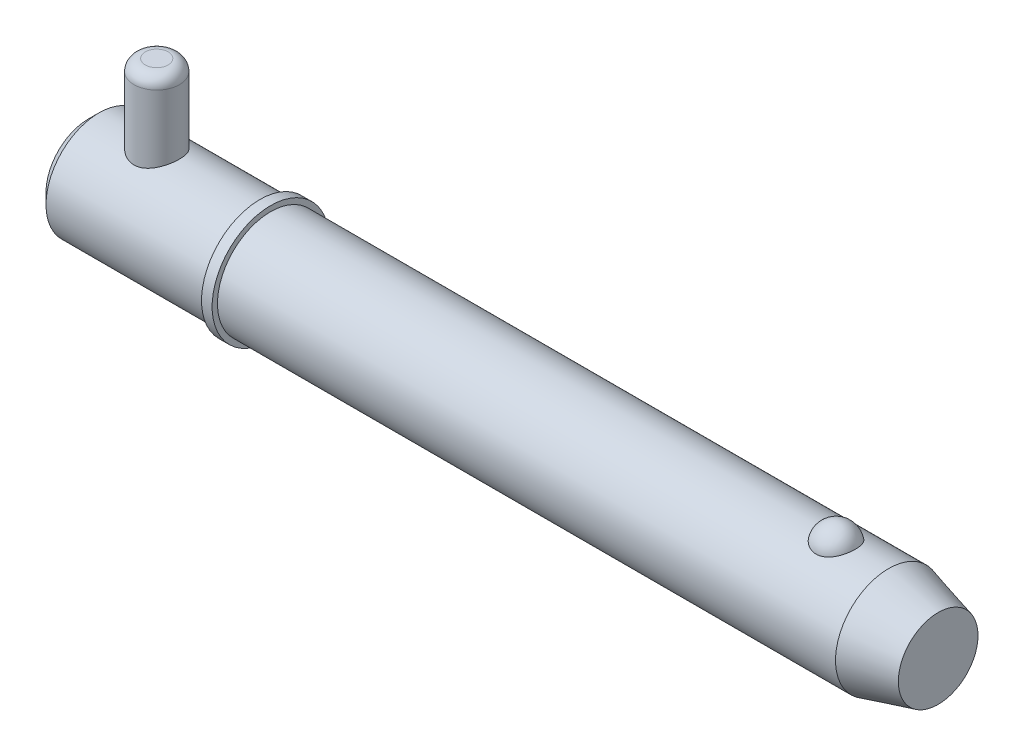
ISO-10303-21;
HEADER;
FILE_DESCRIPTION(('STEP AP214'),'2;1');
FILE_NAME('part.step','',(''),(''),'','','');
FILE_SCHEMA(('AUTOMOTIVE_DESIGN { 1 0 10303 214 1 1 1 1 }'));
ENDSEC;
DATA;
#1=APPLICATION_CONTEXT('core data for automotive mechanical design processes');
#2=APPLICATION_PROTOCOL_DEFINITION('international standard','automotive_design',2000,#1);
#3=PRODUCT_CONTEXT('',#1,'mechanical');
#4=PRODUCT('Part','Part','',(#3));
#5=PRODUCT_RELATED_PRODUCT_CATEGORY('part','',(#4));
#6=PRODUCT_DEFINITION_FORMATION('','',#4);
#7=PRODUCT_DEFINITION_CONTEXT('part definition',#1,'design');
#8=PRODUCT_DEFINITION('design','',#6,#7);
#9=PRODUCT_DEFINITION_SHAPE('','',#8);
#10=(LENGTH_UNIT() NAMED_UNIT(*) SI_UNIT(.MILLI.,.METRE.));
#11=(NAMED_UNIT(*) PLANE_ANGLE_UNIT() SI_UNIT($,.RADIAN.));
#12=(NAMED_UNIT(*) SI_UNIT($,.STERADIAN.) SOLID_ANGLE_UNIT());
#13=UNCERTAINTY_MEASURE_WITH_UNIT(LENGTH_MEASURE(1.E-05),#10,'distance_accuracy_value','');
#14=(GEOMETRIC_REPRESENTATION_CONTEXT(3) GLOBAL_UNCERTAINTY_ASSIGNED_CONTEXT((#13)) GLOBAL_UNIT_ASSIGNED_CONTEXT((#10,
#11,#12)) REPRESENTATION_CONTEXT('',''));
#15=CARTESIAN_POINT('',(0.,0.,0.));
#16=DIRECTION('',(0.,0.,1.));
#17=DIRECTION('',(1.,0.,0.));
#18=AXIS2_PLACEMENT_3D('',#15,#16,#17);
#19=CARTESIAN_POINT('',(14.28,26.985,0.));
#20=DIRECTION('',(0.,-1.,0.));
#21=DIRECTION('',(0.,0.,-1.));
#22=AXIS2_PLACEMENT_3D('',#19,#20,#21);
#23=CYLINDRICAL_SURFACE('',#22,4.76);
#24=CARTESIAN_POINT('',(14.28,-8.73500000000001,0.));
#25=DIRECTION('',(0.,1.,0.));
#26=DIRECTION('',(0.,0.,1.));
#27=AXIS2_PLACEMENT_3D('',#24,#25,#26);
#28=CIRCLE('',#27,4.76);
#29=CARTESIAN_POINT('',(14.28,-8.73500000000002,-4.76));
#30=VERTEX_POINT('',#29);
#31=EDGE_CURVE('P0_E25',#30,#30,#28,.T.);
#32=CARTESIAN_POINT('',(14.28,24.605,0.));
#33=DIRECTION('',(0.,1.,0.));
#34=DIRECTION('',(0.,0.,1.));
#35=AXIS2_PLACEMENT_3D('',#32,#33,#34);
#36=CIRCLE('',#35,4.76);
#37=CARTESIAN_POINT('',(14.28,24.605,-4.76));
#38=VERTEX_POINT('',#37);
#39=EDGE_CURVE('P0_E29',#38,#38,#36,.F.);
#40=CARTESIAN_POINT('',(14.28,-8.73500000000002,-4.76));
#41=CARTESIAN_POINT('',(14.28,-8.38770833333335,-4.76));
#42=CARTESIAN_POINT('',(14.28,-8.04041666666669,-4.76));
#43=CARTESIAN_POINT('',(14.28,-7.34583333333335,-4.76));
#44=CARTESIAN_POINT('',(14.28,-6.99854166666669,-4.76));
#45=CARTESIAN_POINT('',(14.28,-6.30395833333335,-4.76));
#46=CARTESIAN_POINT('',(14.28,-5.95666666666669,-4.76));
#47=CARTESIAN_POINT('',(14.28,-5.26208333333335,-4.76));
#48=CARTESIAN_POINT('',(14.28,-4.91479166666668,-4.76));
#49=CARTESIAN_POINT('',(14.28,-4.22020833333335,-4.76));
#50=CARTESIAN_POINT('',(14.28,-3.87291666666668,-4.76));
#51=CARTESIAN_POINT('',(14.28,-3.17833333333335,-4.76));
#52=CARTESIAN_POINT('',(14.28,-2.83104166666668,-4.76));
#53=CARTESIAN_POINT('',(14.28,-2.13645833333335,-4.76));
#54=CARTESIAN_POINT('',(14.28,-1.78916666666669,-4.76));
#55=CARTESIAN_POINT('',(14.28,-1.09458333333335,-4.76));
#56=CARTESIAN_POINT('',(14.28,-0.747291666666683,-4.76));
#57=CARTESIAN_POINT('',(14.28,-0.052708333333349,-4.76));
#58=CARTESIAN_POINT('',(14.28,0.294583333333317,-4.76));
#59=CARTESIAN_POINT('',(14.28,0.989166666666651,-4.76));
#60=CARTESIAN_POINT('',(14.28,1.33645833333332,-4.76));
#61=CARTESIAN_POINT('',(14.28,2.03104166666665,-4.76));
#62=CARTESIAN_POINT('',(14.28,2.37833333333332,-4.76));
#63=CARTESIAN_POINT('',(14.28,3.07291666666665,-4.76));
#64=CARTESIAN_POINT('',(14.28,3.42020833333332,-4.76));
#65=CARTESIAN_POINT('',(14.28,4.11479166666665,-4.76));
#66=CARTESIAN_POINT('',(14.28,4.46208333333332,-4.76));
#67=CARTESIAN_POINT('',(14.28,5.15666666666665,-4.76));
#68=CARTESIAN_POINT('',(14.28,5.50395833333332,-4.76));
#69=CARTESIAN_POINT('',(14.28,6.19854166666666,-4.76));
#70=CARTESIAN_POINT('',(14.28,6.54583333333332,-4.76));
#71=CARTESIAN_POINT('',(14.28,7.24041666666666,-4.76));
#72=CARTESIAN_POINT('',(14.28,7.58770833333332,-4.76));
#73=CARTESIAN_POINT('',(14.28,8.28229166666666,-4.76));
#74=CARTESIAN_POINT('',(14.28,8.62958333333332,-4.76));
#75=CARTESIAN_POINT('',(14.28,9.32416666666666,-4.76));
#76=CARTESIAN_POINT('',(14.28,9.67145833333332,-4.76));
#77=CARTESIAN_POINT('',(14.28,10.3660416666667,-4.76));
#78=CARTESIAN_POINT('',(14.28,10.7133333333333,-4.76));
#79=CARTESIAN_POINT('',(14.28,11.4079166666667,-4.76));
#80=CARTESIAN_POINT('',(14.28,11.7552083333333,-4.76));
#81=CARTESIAN_POINT('',(14.28,12.4497916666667,-4.76));
#82=CARTESIAN_POINT('',(14.28,12.7970833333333,-4.76));
#83=CARTESIAN_POINT('',(14.28,13.4916666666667,-4.76));
#84=CARTESIAN_POINT('',(14.28,13.8389583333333,-4.76));
#85=CARTESIAN_POINT('',(14.28,14.5335416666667,-4.76));
#86=CARTESIAN_POINT('',(14.28,14.8808333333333,-4.76));
#87=CARTESIAN_POINT('',(14.28,15.5754166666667,-4.76));
#88=CARTESIAN_POINT('',(14.28,15.9227083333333,-4.76));
#89=CARTESIAN_POINT('',(14.28,16.6172916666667,-4.76));
#90=CARTESIAN_POINT('',(14.28,16.9645833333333,-4.76));
#91=CARTESIAN_POINT('',(14.28,17.6591666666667,-4.76));
#92=CARTESIAN_POINT('',(14.28,18.0064583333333,-4.76));
#93=CARTESIAN_POINT('',(14.28,18.7010416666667,-4.76));
#94=CARTESIAN_POINT('',(14.28,19.0483333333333,-4.76));
#95=CARTESIAN_POINT('',(14.28,19.7429166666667,-4.76));
#96=CARTESIAN_POINT('',(14.28,20.0902083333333,-4.76));
#97=CARTESIAN_POINT('',(14.28,20.7847916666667,-4.76));
#98=CARTESIAN_POINT('',(14.28,21.1320833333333,-4.76));
#99=CARTESIAN_POINT('',(14.28,21.8266666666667,-4.76));
#100=CARTESIAN_POINT('',(14.28,22.1739583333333,-4.76));
#101=CARTESIAN_POINT('',(14.28,22.8685416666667,-4.76));
#102=CARTESIAN_POINT('',(14.28,23.2158333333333,-4.76));
#103=CARTESIAN_POINT('',(14.28,23.9104166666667,-4.76));
#104=CARTESIAN_POINT('',(14.28,24.2577083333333,-4.76));
#105=CARTESIAN_POINT('',(14.28,24.605,-4.76));
#106=B_SPLINE_CURVE_WITH_KNOTS('',3,(#40,#41,#42,#43,#44,#45,#46,#47,#48,#49,#50,#51,#52,#53,
#54,#55,#56,#57,#58,#59,#60,#61,#62,#63,#64,#65,#66,#67,#68,#69,#70,#71,#72,#73,#74,#75,#76,#77,
#78,#79,#80,#81,#82,#83,#84,#85,#86,#87,#88,#89,#90,#91,#92,#93,#94,#95,#96,#97,#98,#99,#100,
#101,#102,#103,#104,#105),.UNSPECIFIED.,.F.,.F.,(4,2,2,2,2,2,2,2,2,2,2,2,2,2,2,2,2,2,2,2,2,2,2,
2,2,2,2,2,2,2,2,2,4),(0.,1.041875,2.08375,3.125625,4.1675,5.209375,6.25125,7.293125,
8.33500000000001,9.376875,10.41875,11.460625,12.5025,13.544375,14.58625,15.628125,16.67,
17.711875,18.75375,19.795625,20.8375,21.879375,22.92125,23.963125,25.005,26.046875,27.08875,
28.130625,29.1725,30.214375,31.25625,32.298125,33.34),.UNSPECIFIED.);
#107=EDGE_CURVE('P0_BSEAM14',#30,#38,#106,.T.);
#108=ORIENTED_EDGE('',*,*,#31,.T.);
#109=ORIENTED_EDGE('',*,*,#39,.T.);
#110=ORIENTED_EDGE('',*,*,#107,.T.);
#111=ORIENTED_EDGE('',*,*,#107,.F.);
#112=EDGE_LOOP('',(#108,#110,#109,#111));
#113=FACE_BOUND('',#112,.T.);
#114=ADVANCED_FACE('P0_F14',(#113),#23,.T.);
#115=CARTESIAN_POINT('',(14.28,26.985,0.));
#116=DIRECTION('',(0.,1.,0.));
#117=DIRECTION('',(0.,0.,1.));
#118=AXIS2_PLACEMENT_3D('',#115,#116,#117);
#119=PLANE('',#118);
#120=CARTESIAN_POINT('',(14.28,26.985,0.));
#121=DIRECTION('',(0.,1.,0.));
#122=DIRECTION('',(0.,0.,1.));
#123=AXIS2_PLACEMENT_3D('',#120,#121,#122);
#124=CIRCLE('',#123,2.38);
#125=CARTESIAN_POINT('',(14.28,26.985,2.38));
#126=VERTEX_POINT('',#125);
#127=EDGE_CURVE('P0_E10',#126,#126,#124,.T.);
#128=ORIENTED_EDGE('',*,*,#127,.T.);
#129=EDGE_LOOP('',(#128));
#130=FACE_BOUND('',#129,.T.);
#131=ADVANCED_FACE('P0_F46',(#130),#119,.T.);
#132=CARTESIAN_POINT('',(14.28,-11.115,0.));
#133=DIRECTION('',(0.,1.,0.));
#134=DIRECTION('',(0.,0.,1.));
#135=AXIS2_PLACEMENT_3D('',#132,#133,#134);
#136=PLANE('',#135);
#137=CARTESIAN_POINT('',(14.28,-11.115,0.));
#138=DIRECTION('',(0.,1.,0.));
#139=DIRECTION('',(0.,0.,1.));
#140=AXIS2_PLACEMENT_3D('',#137,#138,#139);
#141=CIRCLE('',#140,2.38);
#142=CARTESIAN_POINT('',(14.28,-11.115,2.38));
#143=VERTEX_POINT('',#142);
#144=EDGE_CURVE('P0_E21',#143,#143,#141,.F.);
#145=ORIENTED_EDGE('',*,*,#144,.T.);
#146=EDGE_LOOP('',(#145));
#147=FACE_BOUND('',#146,.T.);
#148=ADVANCED_FACE('P0_F43',(#147),#136,.F.);
#149=CARTESIAN_POINT('',(14.28,-8.735,0.));
#150=DIRECTION('',(0.,1.,0.));
#151=DIRECTION('',(0.,0.,1.));
#152=AXIS2_PLACEMENT_3D('',#149,#150,#151);
#153=DEGENERATE_TOROIDAL_SURFACE('',#152,2.38,2.38,.T.);
#154=ORIENTED_EDGE('',*,*,#144,.F.);
#155=EDGE_LOOP('',(#154));
#156=FACE_BOUND('',#155,.T.);
#157=ORIENTED_EDGE('',*,*,#31,.F.);
#158=EDGE_LOOP('',(#157));
#159=FACE_BOUND('',#158,.T.);
#160=ADVANCED_FACE('P0_F38',(#156,#159),#153,.T.);
#161=CARTESIAN_POINT('',(14.28,24.605,0.));
#162=DIRECTION('',(0.,1.,0.));
#163=DIRECTION('',(0.,0.,1.));
#164=AXIS2_PLACEMENT_3D('',#161,#162,#163);
#165=DEGENERATE_TOROIDAL_SURFACE('',#164,2.38,2.38,.T.);
#166=ORIENTED_EDGE('',*,*,#39,.F.);
#167=EDGE_LOOP('',(#166));
#168=FACE_BOUND('',#167,.T.);
#169=ORIENTED_EDGE('',*,*,#127,.F.);
#170=EDGE_LOOP('',(#169));
#171=FACE_BOUND('',#170,.T.);
#172=ADVANCED_FACE('P0_F16',(#168,#171),#165,.T.);
#173=CLOSED_SHELL('',(#114,#131,#148,#160,#172));
#174=MANIFOLD_SOLID_BREP('P0_B1',#173);
#175=CARTESIAN_POINT('',(0.,0.,0.));
#176=DIRECTION('',(1.,0.,0.));
#177=DIRECTION('',(0.,0.,-1.));
#178=AXIS2_PLACEMENT_3D('',#175,#176,#177);
#179=CYLINDRICAL_SURFACE('',#178,11.115);
#180=CARTESIAN_POINT('',(167.429563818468,0.,0.));
#181=DIRECTION('',(1.,0.,0.));
#182=DIRECTION('',(0.,0.,-1.));
#183=AXIS2_PLACEMENT_3D('',#180,#181,#182);
#184=CIRCLE('',#183,11.115);
#185=CARTESIAN_POINT('',(167.429563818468,0.,-11.115));
#186=VERTEX_POINT('',#185);
#187=EDGE_CURVE('P1_E81',#186,#186,#184,.T.);
#188=ORIENTED_EDGE('',*,*,#187,.F.);
#189=EDGE_LOOP('',(#188));
#190=FACE_BOUND('',#189,.T.);
#191=CARTESIAN_POINT('',(38.1,0.,0.));
#192=DIRECTION('',(1.,0.,0.));
#193=DIRECTION('',(0.,0.,-1.));
#194=AXIS2_PLACEMENT_3D('',#191,#192,#193);
#195=CIRCLE('',#194,11.115);
#196=CARTESIAN_POINT('',(38.1,0.,-11.115));
#197=VERTEX_POINT('',#196);
#198=EDGE_CURVE('P1_E85',#197,#197,#195,.T.);
#199=ORIENTED_EDGE('',*,*,#198,.T.);
#200=EDGE_LOOP('',(#199));
#201=FACE_BOUND('',#200,.T.);
#202=CARTESIAN_POINT('',(156.431068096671,10.3028087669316,4.17077409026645));
#203=CARTESIAN_POINT('',(156.214775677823,10.3028003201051,4.17078240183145));
#204=CARTESIAN_POINT('',(155.998548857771,10.3098895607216,4.15340593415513));
#205=CARTESIAN_POINT('',(155.572540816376,10.3373834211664,4.08449540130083));
#206=CARTESIAN_POINT('',(155.362757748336,10.3577841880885,4.0329712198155));
#207=CARTESIAN_POINT('',(154.955782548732,10.4095237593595,3.89746513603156));
#208=CARTESIAN_POINT('',(154.758572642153,10.4408466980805,3.81353029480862));
#209=CARTESIAN_POINT('',(154.381338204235,10.5110236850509,3.61560339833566));
#210=CARTESIAN_POINT('',(154.201317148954,10.5498792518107,3.50160528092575));
#211=CARTESIAN_POINT('',(153.857684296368,10.6322884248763,3.24292464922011));
#212=CARTESIAN_POINT('',(153.694686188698,10.6759443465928,3.09746040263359));
#213=CARTESIAN_POINT('',(153.394591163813,10.7625291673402,2.7817192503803));
#214=CARTESIAN_POINT('',(153.257499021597,10.8054579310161,2.61143778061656));
#215=CARTESIAN_POINT('',(153.006408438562,10.8881935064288,2.24226695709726));
#216=CARTESIAN_POINT('',(152.893710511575,10.9277761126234,2.04244123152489));
#217=CARTESIAN_POINT('',(152.701777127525,10.997484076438,1.62578254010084));
#218=CARTESIAN_POINT('',(152.622544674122,11.0276085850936,1.40894804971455));
#219=CARTESIAN_POINT('',(152.498303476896,11.0756732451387,0.961250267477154));
#220=CARTESIAN_POINT('',(152.453760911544,11.0934470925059,0.730239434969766));
#221=CARTESIAN_POINT('',(152.401569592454,11.1143331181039,0.263439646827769));
#222=CARTESIAN_POINT('',(152.393920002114,11.1174456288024,0.0276507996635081));
#223=CARTESIAN_POINT('',(152.41561056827,11.1087161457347,-0.440729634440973));
#224=CARTESIAN_POINT('',(152.444762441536,11.0969502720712,-0.6733313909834));
#225=CARTESIAN_POINT('',(152.539143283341,11.0597872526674,-1.12996621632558));
#226=CARTESIAN_POINT('',(152.604372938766,11.0343898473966,-1.35399912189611));
#227=CARTESIAN_POINT('',(152.76969844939,10.972515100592,-1.78750286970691));
#228=CARTESIAN_POINT('',(152.86983863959,10.9360236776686,-1.99695478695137));
#229=CARTESIAN_POINT('',(153.102940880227,10.8557595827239,-2.39520667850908));
#230=CARTESIAN_POINT('',(153.235905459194,10.8119863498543,-2.58400506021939));
#231=CARTESIAN_POINT('',(153.532407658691,10.7216733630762,-2.93635726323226));
#232=CARTESIAN_POINT('',(153.696056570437,10.675123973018,-3.09981510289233));
#233=CARTESIAN_POINT('',(154.049860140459,10.5846571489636,-3.39592247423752));
#234=CARTESIAN_POINT('',(154.240012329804,10.5407394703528,-3.52857487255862));
#235=CARTESIAN_POINT('',(154.63750141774,10.4616690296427,-3.75646057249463));
#236=CARTESIAN_POINT('',(154.84436705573,10.4263443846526,-3.85245432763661));
#237=CARTESIAN_POINT('',(155.272954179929,10.3675574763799,-4.00798747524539));
#238=CARTESIAN_POINT('',(155.494670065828,10.344090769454,-4.0675405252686));
#239=CARTESIAN_POINT('',(155.934669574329,10.3128282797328,-4.14614314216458));
#240=CARTESIAN_POINT('',(156.152565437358,10.3043040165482,-4.1670783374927));
#241=CARTESIAN_POINT('',(156.58894951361,10.3016771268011,-4.17357158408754));
#242=CARTESIAN_POINT('',(156.807437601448,10.3075716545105,-4.15913661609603));
#243=CARTESIAN_POINT('',(157.231744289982,10.3326686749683,-4.09636961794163));
#244=CARTESIAN_POINT('',(157.437745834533,10.3514555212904,-4.0490957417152));
#245=CARTESIAN_POINT('',(157.838576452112,10.399818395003,-3.92320197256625));
#246=CARTESIAN_POINT('',(158.0334046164,10.4293952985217,-3.84457953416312));
#247=CARTESIAN_POINT('',(158.411191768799,10.4969600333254,-3.65612410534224));
#248=CARTESIAN_POINT('',(158.593797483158,10.5351178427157,-3.54564545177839));
#249=CARTESIAN_POINT('',(158.938204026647,10.6154999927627,-3.29718036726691));
#250=CARTESIAN_POINT('',(159.100000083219,10.657725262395,-3.15918764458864));
#251=CARTESIAN_POINT('',(159.406959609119,10.744212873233,-2.85163580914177));
#252=CARTESIAN_POINT('',(159.550891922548,10.7884718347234,-2.68084605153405));
#253=CARTESIAN_POINT('',(159.809237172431,10.872374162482,-2.31721864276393));
#254=CARTESIAN_POINT('',(159.923644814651,10.9120167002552,-2.12437704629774));
#255=CARTESIAN_POINT('',(160.123873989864,10.9838919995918,-1.71516999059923));
#256=CARTESIAN_POINT('',(160.20866178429,11.0158465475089,-1.49824866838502));
#257=CARTESIAN_POINT('',(160.34268382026,11.0673523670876,-1.05228572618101));
#258=CARTESIAN_POINT('',(160.391917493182,11.086903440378,-0.823243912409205));
#259=CARTESIAN_POINT('',(160.453891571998,11.1116323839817,-0.359087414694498));
#260=CARTESIAN_POINT('',(160.466566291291,11.1167843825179,-0.123962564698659));
#261=CARTESIAN_POINT('',(160.454973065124,11.1121144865,0.345220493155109));
#262=CARTESIAN_POINT('',(160.430705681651,11.1022928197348,0.579278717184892));
#263=CARTESIAN_POINT('',(160.345907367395,11.0687504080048,1.03866534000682));
#264=CARTESIAN_POINT('',(160.285529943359,11.0450885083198,1.26402641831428));
#265=CARTESIAN_POINT('',(160.129853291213,10.9863185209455,1.70076772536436));
#266=CARTESIAN_POINT('',(160.034551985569,10.9512097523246,1.91214712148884));
#267=CARTESIAN_POINT('',(159.810397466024,10.8729733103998,2.316083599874));
#268=CARTESIAN_POINT('',(159.681380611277,10.8298068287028,2.50854240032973));
#269=CARTESIAN_POINT('',(159.392732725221,10.7401896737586,2.86808766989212));
#270=CARTESIAN_POINT('',(159.233102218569,10.6937390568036,3.03517457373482));
#271=CARTESIAN_POINT('',(158.887534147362,10.6029321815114,3.33857581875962));
#272=CARTESIAN_POINT('',(158.701708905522,10.5585680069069,3.47501541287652));
#273=CARTESIAN_POINT('',(158.307875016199,10.4769321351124,3.71390897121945));
#274=CARTESIAN_POINT('',(158.099863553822,10.439661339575,3.81635861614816));
#275=CARTESIAN_POINT('',(157.654066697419,10.3749407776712,3.98910631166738));
#276=CARTESIAN_POINT('',(157.415234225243,10.3482457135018,4.05700929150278));
#277=CARTESIAN_POINT('',(156.927925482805,10.312188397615,4.14782844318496));
#278=CARTESIAN_POINT('',(156.679453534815,10.3028184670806,4.17076454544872));
#279=CARTESIAN_POINT('',(156.431068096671,10.3028087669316,4.17077409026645));
#280=B_SPLINE_CURVE_WITH_KNOTS('',3,(#202,#203,#204,#205,#206,#207,#208,#209,#210,#211,#212,
#213,#214,#215,#216,#217,#218,#219,#220,#221,#222,#223,#224,#225,#226,#227,#228,#229,#230,#231,
#232,#233,#234,#235,#236,#237,#238,#239,#240,#241,#242,#243,#244,#245,#246,#247,#248,#249,#250,
#251,#252,#253,#254,#255,#256,#257,#258,#259,#260,#261,#262,#263,#264,#265,#266,#267,#268,#269,
#270,#271,#272,#273,#274,#275,#276,#277,#278,#279),.UNSPECIFIED.,.T.,.F.,(4,2,2,2,2,2,2,2,2,2,2,
2,2,2,2,2,2,2,2,2,2,2,2,2,2,2,2,2,2,2,2,2,2,2,2,2,2,2,4),(0.,0.64796614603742,1.29574482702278,
1.9425864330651,2.58955857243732,3.25496465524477,3.92049326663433,4.61566368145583,
5.31089647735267,6.01531821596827,6.71972398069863,7.42054043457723,8.12137023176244,
8.82309331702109,9.52487047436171,10.2292439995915,10.9335519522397,11.6223330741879,
12.3108558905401,12.9647664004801,13.6185478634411,14.252184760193,14.8858731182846,
15.5334360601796,16.1811472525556,16.8611459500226,17.5412664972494,18.2431855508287,
18.9451158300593,19.6483065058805,20.3514864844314,21.0516982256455,21.7519516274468,
22.4556690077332,23.1593743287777,23.860149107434,24.5610129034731,25.3054529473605,
26.049562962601),.UNSPECIFIED.);
#281=CARTESIAN_POINT('',(156.431068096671,10.3028087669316,4.17077409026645));
#282=VERTEX_POINT('',#281);
#283=EDGE_CURVE('P1_E35',#282,#282,#280,.T.);
#284=ORIENTED_EDGE('',*,*,#283,.T.);
#285=EDGE_LOOP('',(#284));
#286=FACE_BOUND('',#285,.T.);
#287=ADVANCED_FACE('P1_F13',(#190,#201,#286),#179,.T.);
#288=CARTESIAN_POINT('',(0.,0.,0.));
#289=DIRECTION('',(-1.,0.,0.));
#290=DIRECTION('',(0.,0.,1.));
#291=AXIS2_PLACEMENT_3D('',#288,#289,#290);
#292=PLANE('',#291);
#293=CARTESIAN_POINT('',(0.,0.,0.));
#294=DIRECTION('',(1.,0.,0.));
#295=DIRECTION('',(0.,0.,-1.));
#296=AXIS2_PLACEMENT_3D('',#293,#294,#295);
#297=CIRCLE('',#296,8.892);
#298=CARTESIAN_POINT('',(0.,0.,-8.892));
#299=VERTEX_POINT('',#298);
#300=EDGE_CURVE('P1_E9',#299,#299,#297,.T.);
#301=ORIENTED_EDGE('',*,*,#300,.F.);
#302=EDGE_LOOP('',(#301));
#303=FACE_BOUND('',#302,.T.);
#304=ADVANCED_FACE('P1_F15',(#303),#292,.T.);
#305=CARTESIAN_POINT('',(2.22299999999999,0.,0.));
#306=DIRECTION('',(1.,0.,0.));
#307=DIRECTION('',(0.,0.,-1.));
#308=AXIS2_PLACEMENT_3D('',#305,#306,#307);
#309=CONICAL_SURFACE('',#308,11.115,0.78539816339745);
#310=ORIENTED_EDGE('',*,*,#300,.T.);
#311=EDGE_LOOP('',(#310));
#312=FACE_BOUND('',#311,.T.);
#313=CARTESIAN_POINT('',(2.22299999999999,0.,0.));
#314=DIRECTION('',(1.,0.,0.));
#315=DIRECTION('',(0.,0.,-1.));
#316=AXIS2_PLACEMENT_3D('',#313,#314,#315);
#317=CIRCLE('',#316,11.115);
#318=CARTESIAN_POINT('',(2.22299999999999,0.,-11.115));
#319=VERTEX_POINT('',#318);
#320=EDGE_CURVE('P1_E26',#319,#319,#317,.T.);
#321=ORIENTED_EDGE('',*,*,#320,.F.);
#322=EDGE_LOOP('',(#321));
#323=FACE_BOUND('',#322,.T.);
#324=ADVANCED_FACE('P1_F77',(#312,#323),#309,.T.);
#325=CARTESIAN_POINT('',(0.,0.,0.));
#326=DIRECTION('',(1.,0.,0.));
#327=DIRECTION('',(0.,0.,-1.));
#328=AXIS2_PLACEMENT_3D('',#325,#326,#327);
#329=CYLINDRICAL_SURFACE('',#328,11.115);
#330=CARTESIAN_POINT('',(14.28,-10.0441836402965,4.76));
#331=CARTESIAN_POINT('',(14.1533731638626,-10.0441846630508,4.75999904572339));
#332=CARTESIAN_POINT('',(14.0267055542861,-10.0465865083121,4.75493985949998));
#333=CARTESIAN_POINT('',(13.774298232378,-10.0561141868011,4.73475585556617));
#334=CARTESIAN_POINT('',(13.6485591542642,-10.0632429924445,4.71962470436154));
#335=CARTESIAN_POINT('',(13.3987500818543,-10.0819979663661,4.67942666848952));
#336=CARTESIAN_POINT('',(13.2746840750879,-10.0936334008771,4.65433930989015));
#337=CARTESIAN_POINT('',(13.0293244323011,-10.1210146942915,4.59449317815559));
#338=CARTESIAN_POINT('',(12.9080319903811,-10.1367622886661,4.55973032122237));
#339=CARTESIAN_POINT('',(12.669614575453,-10.1717810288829,4.48106435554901));
#340=CARTESIAN_POINT('',(12.5524727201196,-10.1910352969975,4.4372048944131));
#341=CARTESIAN_POINT('',(12.3224300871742,-10.2325403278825,4.34063417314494));
#342=CARTESIAN_POINT('',(12.2095309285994,-10.2547922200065,4.28791957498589));
#343=CARTESIAN_POINT('',(11.8782785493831,-10.3250879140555,4.11715127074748));
#344=CARTESIAN_POINT('',(11.6670799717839,-10.3767168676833,3.98637638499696));
#345=CARTESIAN_POINT('',(11.2564039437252,-10.4874309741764,3.68567149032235));
#346=CARTESIAN_POINT('',(11.0583793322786,-10.5467772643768,3.51386978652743));
#347=CARTESIAN_POINT('',(10.6927724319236,-10.6641377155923,3.13969960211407));
#348=CARTESIAN_POINT('',(10.5252022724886,-10.7221513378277,2.93731900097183));
#349=CARTESIAN_POINT('',(10.2965609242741,-10.8050020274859,2.60935726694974));
#350=CARTESIAN_POINT('',(10.2227768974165,-10.8324811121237,2.49310321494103));
#351=CARTESIAN_POINT('',(10.0853380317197,-10.884703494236,2.25418999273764));
#352=CARTESIAN_POINT('',(10.0216789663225,-10.9094479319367,2.13153352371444));
#353=CARTESIAN_POINT('',(9.90506238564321,-10.9554932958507,1.88060370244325));
#354=CARTESIAN_POINT('',(9.85210574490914,-10.9767939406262,1.7523298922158));
#355=CARTESIAN_POINT('',(9.75746464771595,-11.0153112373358,1.49115740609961));
#356=CARTESIAN_POINT('',(9.71577447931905,-11.0325299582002,1.35826111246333));
#357=CARTESIAN_POINT('',(9.64605475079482,-11.0615607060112,1.09614539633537));
#358=CARTESIAN_POINT('',(9.61740732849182,-11.0736151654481,0.96711700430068));
#359=CARTESIAN_POINT('',(9.57092026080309,-11.0932687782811,0.706847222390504));
#360=CARTESIAN_POINT('',(9.55307574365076,-11.1008699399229,0.575606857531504));
#361=CARTESIAN_POINT('',(9.52838640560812,-11.1114054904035,0.31192917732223));
#362=CARTESIAN_POINT('',(9.52153986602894,-11.114340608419,0.179492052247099));
#363=CARTESIAN_POINT('',(9.51892405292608,-11.1154607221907,-0.0855090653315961));
#364=CARTESIAN_POINT('',(9.52315432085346,-11.1136459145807,-0.218073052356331));
#365=CARTESIAN_POINT('',(9.542009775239,-11.1055891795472,-0.473709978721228));
#366=CARTESIAN_POINT('',(9.55594693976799,-11.099640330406,-0.596843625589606));
#367=CARTESIAN_POINT('',(9.59332832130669,-11.0837823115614,-0.841440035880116));
#368=CARTESIAN_POINT('',(9.61677567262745,-11.0738718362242,-0.962902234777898));
#369=CARTESIAN_POINT('',(9.67294089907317,-11.0503378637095,-1.20325684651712));
#370=CARTESIAN_POINT('',(9.70565569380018,-11.0367156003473,-1.32215009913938));
#371=CARTESIAN_POINT('',(9.78005008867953,-11.0060908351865,-1.55666640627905));
#372=CARTESIAN_POINT('',(9.82173311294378,-10.9890870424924,-1.67228819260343));
#373=CARTESIAN_POINT('',(9.96110379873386,-10.9330280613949,-2.01656166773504));
#374=CARTESIAN_POINT('',(10.0722987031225,-10.8892801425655,-2.23915547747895));
#375=CARTESIAN_POINT('',(10.3268588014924,-10.7934745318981,-2.66299199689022));
#376=CARTESIAN_POINT('',(10.4702355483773,-10.7414138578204,-2.86422700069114));
#377=CARTESIAN_POINT('',(10.7973904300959,-10.6296201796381,-3.25557775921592));
#378=CARTESIAN_POINT('',(10.9833705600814,-10.569604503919,-3.443774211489));
#379=CARTESIAN_POINT('',(11.3844486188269,-10.4514707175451,-3.78722133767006));
#380=CARTESIAN_POINT('',(11.5995590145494,-10.3933534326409,-3.94245783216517));
#381=CARTESIAN_POINT('',(11.9444340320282,-10.311516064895,-4.14990014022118));
#382=CARTESIAN_POINT('',(12.0654579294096,-10.2847012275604,-4.21573894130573));
#383=CARTESIAN_POINT('',(12.3132718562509,-10.2342051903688,-4.33688518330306));
#384=CARTESIAN_POINT('',(12.4400593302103,-10.2105226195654,-4.39219723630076));
#385=CARTESIAN_POINT('',(12.6985418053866,-10.1671237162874,-4.49174500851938));
#386=CARTESIAN_POINT('',(12.8302359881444,-10.1474067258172,-4.53598256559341));
#387=CARTESIAN_POINT('',(13.0975061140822,-10.1126841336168,-4.61287629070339));
#388=CARTESIAN_POINT('',(13.233079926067,-10.0976759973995,-4.64553869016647));
#389=CARTESIAN_POINT('',(13.4978553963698,-10.0737863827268,-4.6971059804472));
#390=CARTESIAN_POINT('',(13.6268754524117,-10.0645618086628,-4.716785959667));
#391=CARTESIAN_POINT('',(13.8862990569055,-10.051062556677,-4.74548419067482));
#392=CARTESIAN_POINT('',(14.0167019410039,-10.0467856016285,-4.75450734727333));
#393=CARTESIAN_POINT('',(14.277859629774,-10.0433352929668,-4.76179143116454));
#394=CARTESIAN_POINT('',(14.4086143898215,-10.0441613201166,-4.76005366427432));
#395=CARTESIAN_POINT('',(14.6694025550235,-10.0508838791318,-4.74584231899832));
#396=CARTESIAN_POINT('',(14.7994359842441,-10.0567802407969,-4.73336910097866));
#397=CARTESIAN_POINT('',(15.0487369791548,-10.0728449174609,-4.69907984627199));
#398=CARTESIAN_POINT('',(15.1681238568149,-10.0826872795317,-4.67797462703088));
#399=CARTESIAN_POINT('',(15.4045894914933,-10.1062580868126,-4.62682977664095));
#400=CARTESIAN_POINT('',(15.5216674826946,-10.1199877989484,-4.59678723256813));
#401=CARTESIAN_POINT('',(15.868278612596,-10.1664161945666,-4.49365911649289));
#402=CARTESIAN_POINT('',(16.0933756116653,-10.2043671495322,-4.40754694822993));
#403=CARTESIAN_POINT('',(16.5357981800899,-10.2919879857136,-4.19898201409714));
#404=CARTESIAN_POINT('',(16.7523611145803,-10.3420954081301,-4.07511281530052));
#405=CARTESIAN_POINT('',(17.1627188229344,-10.4477911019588,-3.7959429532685));
#406=CARTESIAN_POINT('',(17.3565033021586,-10.5033818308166,-3.64062816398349));
#407=CARTESIAN_POINT('',(17.7334034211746,-10.6196376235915,-3.28693729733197));
#408=CARTESIAN_POINT('',(17.9141276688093,-10.6803237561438,-3.08599175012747));
#409=CARTESIAN_POINT('',(18.1582189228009,-10.7666348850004,-2.76320365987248));
#410=CARTESIAN_POINT('',(18.2351223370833,-10.7946346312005,-2.65197124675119));
#411=CARTESIAN_POINT('',(18.3793967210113,-10.8483267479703,-2.42297927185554));
#412=CARTESIAN_POINT('',(18.4467718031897,-10.87402011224,-2.30522255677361));
#413=CARTESIAN_POINT('',(18.5717669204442,-10.9225249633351,-2.06324665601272));
#414=CARTESIAN_POINT('',(18.6293326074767,-10.9453202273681,-1.93899615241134));
#415=CARTESIAN_POINT('',(18.73370006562,-10.9872100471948,-1.6855059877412));
#416=CARTESIAN_POINT('',(18.7805065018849,-11.0063062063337,-1.55626851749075));
#417=CARTESIAN_POINT('',(18.8628731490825,-11.0402419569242,-1.29375150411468));
#418=CARTESIAN_POINT('',(18.8984366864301,-11.0550828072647,-1.16047316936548));
#419=CARTESIAN_POINT('',(18.9579183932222,-11.0800638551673,-0.890912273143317));
#420=CARTESIAN_POINT('',(18.9818374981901,-11.0902044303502,-0.75462995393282));
#421=CARTESIAN_POINT('',(19.0164177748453,-11.104911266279,-0.490295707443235));
#422=CARTESIAN_POINT('',(19.027922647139,-11.1098318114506,-0.362373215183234));
#423=CARTESIAN_POINT('',(19.040554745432,-11.1152360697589,-0.105876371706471));
#424=CARTESIAN_POINT('',(19.0416784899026,-11.1157182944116,0.0226981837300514));
#425=CARTESIAN_POINT('',(19.0335275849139,-11.1122291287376,0.27938352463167));
#426=CARTESIAN_POINT('',(19.0242587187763,-11.1082602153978,0.407494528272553));
#427=CARTESIAN_POINT('',(18.9954320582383,-11.0959792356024,0.662388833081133));
#428=CARTESIAN_POINT('',(18.9758704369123,-11.0876655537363,0.789171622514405));
#429=CARTESIAN_POINT('',(18.9276379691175,-11.0673259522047,1.03545890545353));
#430=CARTESIAN_POINT('',(18.8993573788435,-11.0554596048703,1.15505309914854));
#431=CARTESIAN_POINT('',(18.8337694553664,-11.0282166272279,1.39134516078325));
#432=CARTESIAN_POINT('',(18.7964589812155,-11.0128387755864,1.5080420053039));
#433=CARTESIAN_POINT('',(18.671464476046,-10.9619666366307,1.85262797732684));
#434=CARTESIAN_POINT('',(18.5706772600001,-10.9217161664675,2.07521484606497));
#435=CARTESIAN_POINT('',(18.33202463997,-10.8301378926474,2.51061719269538));
#436=CARTESIAN_POINT('',(18.1926775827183,-10.7783885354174,2.72252375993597));
#437=CARTESIAN_POINT('',(17.8829747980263,-10.669863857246,3.12088015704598));
#438=CARTESIAN_POINT('',(17.7126068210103,-10.6130865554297,3.30731987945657));
#439=CARTESIAN_POINT('',(17.3310036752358,-10.495668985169,3.66358491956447));
#440=CARTESIAN_POINT('',(17.1177010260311,-10.4350471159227,3.83122543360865));
#441=CARTESIAN_POINT('',(16.7778915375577,-10.3495418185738,4.05420569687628));
#442=CARTESIAN_POINT('',(16.6612023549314,-10.3219229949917,4.12383380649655));
#443=CARTESIAN_POINT('',(16.4218466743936,-10.2693487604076,4.25306463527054));
#444=CARTESIAN_POINT('',(16.2991829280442,-10.2443921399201,4.31267191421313));
#445=CARTESIAN_POINT('',(16.0488008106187,-10.1979981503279,4.42126071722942));
#446=CARTESIAN_POINT('',(15.9210894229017,-10.1765561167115,4.47025635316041));
#447=CARTESIAN_POINT('',(15.6613937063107,-10.1379191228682,4.55720152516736));
#448=CARTESIAN_POINT('',(15.5294115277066,-10.1207220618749,4.59515652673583));
#449=CARTESIAN_POINT('',(15.2624981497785,-10.091252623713,4.65951684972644));
#450=CARTESIAN_POINT('',(15.1275757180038,-10.0789672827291,4.68595259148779));
#451=CARTESIAN_POINT('',(14.8556442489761,-10.0597530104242,4.72706206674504));
#452=CARTESIAN_POINT('',(14.7186368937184,-10.0528199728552,4.74174481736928));
#453=CARTESIAN_POINT('',(14.5310955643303,-10.047196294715,4.75363843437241));
#454=CARTESIAN_POINT('',(14.48091543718,-10.0460674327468,4.75602323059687));
#455=CARTESIAN_POINT('',(14.3804923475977,-10.044560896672,4.7592042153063));
#456=CARTESIAN_POINT('',(14.3302493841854,-10.0441832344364,4.76000037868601));
#457=CARTESIAN_POINT('',(14.28,-10.0441836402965,4.76));
#458=B_SPLINE_CURVE_WITH_KNOTS('',3,(#330,#331,#332,#333,#334,#335,#336,#337,#338,#339,#340,
#341,#342,#343,#344,#345,#346,#347,#348,#349,#350,#351,#352,#353,#354,#355,#356,#357,#358,#359,
#360,#361,#362,#363,#364,#365,#366,#367,#368,#369,#370,#371,#372,#373,#374,#375,#376,#377,#378,
#379,#380,#381,#382,#383,#384,#385,#386,#387,#388,#389,#390,#391,#392,#393,#394,#395,#396,#397,
#398,#399,#400,#401,#402,#403,#404,#405,#406,#407,#408,#409,#410,#411,#412,#413,#414,#415,#416,
#417,#418,#419,#420,#421,#422,#423,#424,#425,#426,#427,#428,#429,#430,#431,#432,#433,#434,#435,
#436,#437,#438,#439,#440,#441,#442,#443,#444,#445,#446,#447,#448,#449,#450,#451,#452,#453,#454,
#455,#456,#457),.UNSPECIFIED.,.T.,.F.,(4,2,2,2,2,2,2,2,2,2,2,2,2,2,2,2,2,2,2,2,2,2,2,2,2,2,2,2,
2,2,2,2,2,2,2,2,2,2,2,2,2,2,2,2,2,2,2,2,2,2,2,2,2,2,2,2,2,2,2,2,2,2,2,4),(0.,0.379828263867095,
0.759895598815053,1.14074858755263,1.52176256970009,1.90098898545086,2.28035867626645,
3.03818035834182,3.84125131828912,4.6446414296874,5.06541657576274,5.48601561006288,
5.90664899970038,6.3270687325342,6.72470503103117,7.12216187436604,7.51955659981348,
7.91693487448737,8.28868404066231,8.66055582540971,9.03230414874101,9.40419465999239,
10.1585834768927,10.9132435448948,11.7236471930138,12.5343987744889,12.9550196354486,
13.3754557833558,13.7958221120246,14.2159617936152,14.6079540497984,14.9997658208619,
15.3915300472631,15.7832811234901,16.1477615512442,16.512360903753,17.240999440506,
18.0012974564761,18.761937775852,19.5886929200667,20.0025782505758,20.4162843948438,
20.832212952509,21.2479608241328,21.6635855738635,22.0791769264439,22.4642880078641,
22.8495282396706,23.2345541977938,23.6197234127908,23.9896813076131,24.3597680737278,
25.099327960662,25.8726239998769,26.6462260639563,27.4759193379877,27.8914891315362,
28.3068693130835,28.7216936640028,29.1363123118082,29.5498292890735,29.9630287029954,
30.113753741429,30.2644811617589),.UNSPECIFIED.);
#459=CARTESIAN_POINT('',(14.28,-10.0441836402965,4.76));
#460=VERTEX_POINT('',#459);
#461=EDGE_CURVE('P1_E17',#460,#460,#458,.T.);
#462=ORIENTED_EDGE('',*,*,#461,.F.);
#463=EDGE_LOOP('',(#462));
#464=FACE_BOUND('',#463,.T.);
#465=CARTESIAN_POINT('',(14.28,10.0441836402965,4.76));
#466=CARTESIAN_POINT('',(14.4066268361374,10.0441846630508,4.75999904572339));
#467=CARTESIAN_POINT('',(14.5332944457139,10.0465865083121,4.75493985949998));
#468=CARTESIAN_POINT('',(14.785701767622,10.0561141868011,4.73475585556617));
#469=CARTESIAN_POINT('',(14.9114408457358,10.0632429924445,4.71962470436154));
#470=CARTESIAN_POINT('',(15.1612499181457,10.0819979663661,4.67942666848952));
#471=CARTESIAN_POINT('',(15.2853159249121,10.0936334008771,4.65433930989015));
#472=CARTESIAN_POINT('',(15.5306755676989,10.1210146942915,4.59449317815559));
#473=CARTESIAN_POINT('',(15.6519680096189,10.1367622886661,4.55973032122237));
#474=CARTESIAN_POINT('',(15.890385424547,10.1717810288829,4.48106435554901));
#475=CARTESIAN_POINT('',(16.0075272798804,10.1910352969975,4.4372048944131));
#476=CARTESIAN_POINT('',(16.2375699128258,10.2325403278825,4.34063417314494));
#477=CARTESIAN_POINT('',(16.3504690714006,10.2547922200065,4.28791957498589));
#478=CARTESIAN_POINT('',(16.6817214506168,10.3250879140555,4.11715127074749));
#479=CARTESIAN_POINT('',(16.8929200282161,10.3767168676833,3.98637638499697));
#480=CARTESIAN_POINT('',(17.3035960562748,10.4874309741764,3.68567149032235));
#481=CARTESIAN_POINT('',(17.5016206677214,10.5467772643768,3.51386978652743));
#482=CARTESIAN_POINT('',(17.8672275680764,10.6641377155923,3.13969960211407));
#483=CARTESIAN_POINT('',(18.0347977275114,10.7221513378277,2.93731900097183));
#484=CARTESIAN_POINT('',(18.2634390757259,10.8050020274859,2.60935726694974));
#485=CARTESIAN_POINT('',(18.3372231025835,10.8324811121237,2.49310321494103));
#486=CARTESIAN_POINT('',(18.4746619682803,10.884703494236,2.25418999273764));
#487=CARTESIAN_POINT('',(18.5383210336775,10.9094479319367,2.13153352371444));
#488=CARTESIAN_POINT('',(18.6549376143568,10.9554932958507,1.88060370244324));
#489=CARTESIAN_POINT('',(18.7078942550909,10.9767939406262,1.75232989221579));
#490=CARTESIAN_POINT('',(18.8025353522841,11.0153112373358,1.4911574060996));
#491=CARTESIAN_POINT('',(18.844225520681,11.0325299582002,1.35826111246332));
#492=CARTESIAN_POINT('',(18.9139452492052,11.0615607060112,1.09614539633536));
#493=CARTESIAN_POINT('',(18.9425926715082,11.0736151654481,0.967117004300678));
#494=CARTESIAN_POINT('',(18.9890797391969,11.0932687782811,0.706847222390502));
#495=CARTESIAN_POINT('',(19.0069242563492,11.1008699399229,0.575606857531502));
#496=CARTESIAN_POINT('',(19.0316135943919,11.1114054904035,0.311929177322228));
#497=CARTESIAN_POINT('',(19.0384601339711,11.114340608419,0.179492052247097));
#498=CARTESIAN_POINT('',(19.0410759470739,11.1154607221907,-0.0855090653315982));
#499=CARTESIAN_POINT('',(19.0368456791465,11.1136459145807,-0.218073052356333));
#500=CARTESIAN_POINT('',(19.017990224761,11.1055891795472,-0.47370997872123));
#501=CARTESIAN_POINT('',(19.004053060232,11.099640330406,-0.596843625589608));
#502=CARTESIAN_POINT('',(18.9666716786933,11.0837823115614,-0.841440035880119));
#503=CARTESIAN_POINT('',(18.9432243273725,11.0738718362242,-0.9629022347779));
#504=CARTESIAN_POINT('',(18.8870591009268,11.0503378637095,-1.20325684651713));
#505=CARTESIAN_POINT('',(18.8543443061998,11.0367156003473,-1.32215009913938));
#506=CARTESIAN_POINT('',(18.7799499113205,11.0060908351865,-1.55666640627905));
#507=CARTESIAN_POINT('',(18.7382668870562,10.9890870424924,-1.67228819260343));
#508=CARTESIAN_POINT('',(18.5988962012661,10.9330280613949,-2.01656166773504));
#509=CARTESIAN_POINT('',(18.4877012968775,10.8892801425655,-2.23915547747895));
#510=CARTESIAN_POINT('',(18.2331411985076,10.7934745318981,-2.66299199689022));
#511=CARTESIAN_POINT('',(18.0897644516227,10.7414138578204,-2.86422700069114));
#512=CARTESIAN_POINT('',(17.7626095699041,10.6296201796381,-3.25557775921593));
#513=CARTESIAN_POINT('',(17.5766294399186,10.569604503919,-3.443774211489));
#514=CARTESIAN_POINT('',(17.1755513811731,10.4514707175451,-3.78722133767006));
#515=CARTESIAN_POINT('',(16.9604409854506,10.3933534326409,-3.94245783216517));
#516=CARTESIAN_POINT('',(16.6155659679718,10.311516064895,-4.14990014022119));
#517=CARTESIAN_POINT('',(16.4945420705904,10.2847012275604,-4.21573894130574));
#518=CARTESIAN_POINT('',(16.2467281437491,10.2342051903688,-4.33688518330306));
#519=CARTESIAN_POINT('',(16.1199406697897,10.2105226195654,-4.39219723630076));
#520=CARTESIAN_POINT('',(15.8614581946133,10.1671237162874,-4.49174500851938));
#521=CARTESIAN_POINT('',(15.7297640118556,10.1474067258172,-4.53598256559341));
#522=CARTESIAN_POINT('',(15.4624938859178,10.1126841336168,-4.61287629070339));
#523=CARTESIAN_POINT('',(15.326920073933,10.0976759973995,-4.64553869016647));
#524=CARTESIAN_POINT('',(15.0621446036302,10.0737863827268,-4.6971059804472));
#525=CARTESIAN_POINT('',(14.9331245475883,10.0645618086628,-4.716785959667));
#526=CARTESIAN_POINT('',(14.6737009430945,10.051062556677,-4.74548419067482));
#527=CARTESIAN_POINT('',(14.543298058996,10.0467856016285,-4.75450734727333));
#528=CARTESIAN_POINT('',(14.2821403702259,10.0433352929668,-4.76179143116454));
#529=CARTESIAN_POINT('',(14.1513856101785,10.0441613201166,-4.76005366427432));
#530=CARTESIAN_POINT('',(13.8905974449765,10.0508838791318,-4.74584231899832));
#531=CARTESIAN_POINT('',(13.7605640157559,10.0567802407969,-4.73336910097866));
#532=CARTESIAN_POINT('',(13.5112630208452,10.0728449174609,-4.69907984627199));
#533=CARTESIAN_POINT('',(13.3918761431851,10.0826872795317,-4.67797462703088));
#534=CARTESIAN_POINT('',(13.1554105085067,10.1062580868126,-4.62682977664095));
#535=CARTESIAN_POINT('',(13.0383325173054,10.1199877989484,-4.59678723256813));
#536=CARTESIAN_POINT('',(12.691721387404,10.1664161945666,-4.49365911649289));
#537=CARTESIAN_POINT('',(12.4666243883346,10.2043671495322,-4.40754694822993));
#538=CARTESIAN_POINT('',(12.0242018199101,10.2919879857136,-4.19898201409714));
#539=CARTESIAN_POINT('',(11.8076388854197,10.3420954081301,-4.07511281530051));
#540=CARTESIAN_POINT('',(11.3972811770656,10.4477911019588,-3.7959429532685));
#541=CARTESIAN_POINT('',(11.2034966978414,10.5033818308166,-3.64062816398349));
#542=CARTESIAN_POINT('',(10.8265965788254,10.6196376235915,-3.28693729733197));
#543=CARTESIAN_POINT('',(10.6458723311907,10.6803237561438,-3.08599175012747));
#544=CARTESIAN_POINT('',(10.4017810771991,10.7666348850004,-2.76320365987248));
#545=CARTESIAN_POINT('',(10.3248776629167,10.7946346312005,-2.65197124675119));
#546=CARTESIAN_POINT('',(10.1806032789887,10.8483267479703,-2.42297927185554));
#547=CARTESIAN_POINT('',(10.1132281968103,10.87402011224,-2.30522255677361));
#548=CARTESIAN_POINT('',(9.98823307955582,10.9225249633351,-2.06324665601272));
#549=CARTESIAN_POINT('',(9.93066739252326,10.9453202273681,-1.93899615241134));
#550=CARTESIAN_POINT('',(9.82629993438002,10.9872100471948,-1.6855059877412));
#551=CARTESIAN_POINT('',(9.77949349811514,11.0063062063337,-1.55626851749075));
#552=CARTESIAN_POINT('',(9.69712685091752,11.0402419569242,-1.29375150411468));
#553=CARTESIAN_POINT('',(9.66156331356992,11.0550828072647,-1.16047316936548));
#554=CARTESIAN_POINT('',(9.60208160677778,11.0800638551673,-0.890912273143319));
#555=CARTESIAN_POINT('',(9.57816250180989,11.0902044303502,-0.754629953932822));
#556=CARTESIAN_POINT('',(9.54358222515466,11.104911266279,-0.490295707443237));
#557=CARTESIAN_POINT('',(9.53207735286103,11.1098318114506,-0.362373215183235));
#558=CARTESIAN_POINT('',(9.51944525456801,11.1152360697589,-0.105876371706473));
#559=CARTESIAN_POINT('',(9.51832151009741,11.1157182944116,0.0226981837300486));
#560=CARTESIAN_POINT('',(9.52647241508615,11.1122291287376,0.279383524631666));
#561=CARTESIAN_POINT('',(9.53574128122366,11.1082602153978,0.407494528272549));
#562=CARTESIAN_POINT('',(9.5645679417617,11.0959792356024,0.662388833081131));
#563=CARTESIAN_POINT('',(9.58412956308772,11.0876655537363,0.789171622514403));
#564=CARTESIAN_POINT('',(9.63236203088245,11.0673259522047,1.03545890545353));
#565=CARTESIAN_POINT('',(9.66064262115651,11.0554596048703,1.15505309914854));
#566=CARTESIAN_POINT('',(9.72623054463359,11.0282166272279,1.39134516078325));
#567=CARTESIAN_POINT('',(9.76354101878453,11.0128387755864,1.5080420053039));
#568=CARTESIAN_POINT('',(9.88853552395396,10.9619666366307,1.85262797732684));
#569=CARTESIAN_POINT('',(9.98932273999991,10.9217161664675,2.07521484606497));
#570=CARTESIAN_POINT('',(10.22797536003,10.8301378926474,2.51061719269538));
#571=CARTESIAN_POINT('',(10.3673224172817,10.7783885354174,2.72252375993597));
#572=CARTESIAN_POINT('',(10.6770252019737,10.669863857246,3.12088015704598));
#573=CARTESIAN_POINT('',(10.8473931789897,10.6130865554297,3.30731987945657));
#574=CARTESIAN_POINT('',(11.2289963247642,10.495668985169,3.66358491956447));
#575=CARTESIAN_POINT('',(11.4422989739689,10.4350471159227,3.83122543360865));
#576=CARTESIAN_POINT('',(11.7821084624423,10.3495418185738,4.05420569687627));
#577=CARTESIAN_POINT('',(11.8987976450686,10.3219229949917,4.12383380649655));
#578=CARTESIAN_POINT('',(12.1381533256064,10.2693487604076,4.25306463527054));
#579=CARTESIAN_POINT('',(12.2608170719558,10.2443921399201,4.31267191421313));
#580=CARTESIAN_POINT('',(12.5111991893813,10.1979981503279,4.42126071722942));
#581=CARTESIAN_POINT('',(12.6389105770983,10.1765561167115,4.47025635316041));
#582=CARTESIAN_POINT('',(12.8986062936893,10.1379191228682,4.55720152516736));
#583=CARTESIAN_POINT('',(13.0305884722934,10.1207220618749,4.59515652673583));
#584=CARTESIAN_POINT('',(13.2975018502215,10.091252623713,4.65951684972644));
#585=CARTESIAN_POINT('',(13.4324242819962,10.0789672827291,4.68595259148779));
#586=CARTESIAN_POINT('',(13.7043557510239,10.0597530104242,4.72706206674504));
#587=CARTESIAN_POINT('',(13.8413631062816,10.0528199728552,4.74174481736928));
#588=CARTESIAN_POINT('',(14.0289044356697,10.047196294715,4.75363843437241));
#589=CARTESIAN_POINT('',(14.07908456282,10.0460674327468,4.75602323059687));
#590=CARTESIAN_POINT('',(14.1795076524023,10.044560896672,4.7592042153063));
#591=CARTESIAN_POINT('',(14.2297506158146,10.0441832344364,4.76000037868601));
#592=CARTESIAN_POINT('',(14.28,10.0441836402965,4.76));
#593=B_SPLINE_CURVE_WITH_KNOTS('',3,(#465,#466,#467,#468,#469,#470,#471,#472,#473,#474,#475,
#476,#477,#478,#479,#480,#481,#482,#483,#484,#485,#486,#487,#488,#489,#490,#491,#492,#493,#494,
#495,#496,#497,#498,#499,#500,#501,#502,#503,#504,#505,#506,#507,#508,#509,#510,#511,#512,#513,
#514,#515,#516,#517,#518,#519,#520,#521,#522,#523,#524,#525,#526,#527,#528,#529,#530,#531,#532,
#533,#534,#535,#536,#537,#538,#539,#540,#541,#542,#543,#544,#545,#546,#547,#548,#549,#550,#551,
#552,#553,#554,#555,#556,#557,#558,#559,#560,#561,#562,#563,#564,#565,#566,#567,#568,#569,#570,
#571,#572,#573,#574,#575,#576,#577,#578,#579,#580,#581,#582,#583,#584,#585,#586,#587,#588,#589,
#590,#591,#592),.UNSPECIFIED.,.T.,.F.,(4,2,2,2,2,2,2,2,2,2,2,2,2,2,2,2,2,2,2,2,2,2,2,2,2,2,2,2,
2,2,2,2,2,2,2,2,2,2,2,2,2,2,2,2,2,2,2,2,2,2,2,2,2,2,2,2,2,2,2,2,2,2,2,4),(0.,0.379828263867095,
0.759895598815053,1.14074858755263,1.52176256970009,1.90098898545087,2.28035867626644,
3.03818035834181,3.84125131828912,4.6446414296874,5.06541657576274,5.48601561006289,
5.90664899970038,6.3270687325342,6.72470503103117,7.12216187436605,7.51955659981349,
7.91693487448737,8.28868404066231,8.66055582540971,9.03230414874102,9.4041946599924,
10.1585834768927,10.9132435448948,11.7236471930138,12.5343987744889,12.9550196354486,
13.3754557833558,13.7958221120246,14.2159617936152,14.6079540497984,14.9997658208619,
15.3915300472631,15.7832811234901,16.1477615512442,16.512360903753,17.240999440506,
18.0012974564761,18.761937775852,19.5886929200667,20.0025782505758,20.4162843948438,
20.832212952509,21.2479608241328,21.6635855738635,22.0791769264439,22.4642880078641,
22.8495282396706,23.2345541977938,23.6197234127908,23.9896813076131,24.3597680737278,
25.099327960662,25.8726239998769,26.6462260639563,27.4759193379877,27.8914891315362,
28.3068693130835,28.7216936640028,29.1363123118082,29.5498292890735,29.9630287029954,
30.113753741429,30.2644811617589),.UNSPECIFIED.);
#594=CARTESIAN_POINT('',(14.28,10.0441836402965,4.76));
#595=VERTEX_POINT('',#594);
#596=EDGE_CURVE('P1_E43',#595,#595,#593,.T.);
#597=ORIENTED_EDGE('',*,*,#596,.F.);
#598=EDGE_LOOP('',(#597));
#599=FACE_BOUND('',#598,.T.);
#600=ORIENTED_EDGE('',*,*,#320,.T.);
#601=EDGE_LOOP('',(#600));
#602=FACE_BOUND('',#601,.T.);
#603=CARTESIAN_POINT('',(35.877,0.,0.));
#604=DIRECTION('',(1.,0.,0.));
#605=DIRECTION('',(0.,0.,-1.));
#606=AXIS2_PLACEMENT_3D('',#603,#604,#605);
#607=CIRCLE('',#606,11.115);
#608=CARTESIAN_POINT('',(35.877,0.,-11.115));
#609=VERTEX_POINT('',#608);
#610=EDGE_CURVE('P1_E31',#609,#609,#607,.T.);
#611=ORIENTED_EDGE('',*,*,#610,.F.);
#612=EDGE_LOOP('',(#611));
#613=FACE_BOUND('',#612,.T.);
#614=ADVANCED_FACE('P1_F103',(#464,#599,#602,#613),#329,.T.);
#615=CARTESIAN_POINT('',(35.877,11.115,0.));
#616=DIRECTION('',(-1.,0.,0.));
#617=DIRECTION('',(0.,0.,1.));
#618=AXIS2_PLACEMENT_3D('',#615,#616,#617);
#619=PLANE('',#618);
#620=ORIENTED_EDGE('',*,*,#610,.T.);
#621=EDGE_LOOP('',(#620));
#622=FACE_BOUND('',#621,.T.);
#623=CARTESIAN_POINT('',(35.877,0.,0.));
#624=DIRECTION('',(1.,0.,0.));
#625=DIRECTION('',(0.,0.,-1.));
#626=AXIS2_PLACEMENT_3D('',#623,#624,#625);
#627=CIRCLE('',#626,12.2265);
#628=CARTESIAN_POINT('',(35.877,0.,-12.2265));
#629=VERTEX_POINT('',#628);
#630=EDGE_CURVE('P1_E91',#629,#629,#627,.T.);
#631=ORIENTED_EDGE('',*,*,#630,.F.);
#632=EDGE_LOOP('',(#631));
#633=FACE_BOUND('',#632,.T.);
#634=ADVANCED_FACE('P1_F100',(#622,#633),#619,.T.);
#635=CARTESIAN_POINT('',(0.,0.,0.));
#636=DIRECTION('',(1.,0.,0.));
#637=DIRECTION('',(0.,0.,-1.));
#638=AXIS2_PLACEMENT_3D('',#635,#636,#637);
#639=CYLINDRICAL_SURFACE('',#638,12.2265);
#640=ORIENTED_EDGE('',*,*,#630,.T.);
#641=EDGE_LOOP('',(#640));
#642=FACE_BOUND('',#641,.T.);
#643=CARTESIAN_POINT('',(38.1,0.,0.));
#644=DIRECTION('',(1.,0.,0.));
#645=DIRECTION('',(0.,0.,-1.));
#646=AXIS2_PLACEMENT_3D('',#643,#644,#645);
#647=CIRCLE('',#646,12.2265);
#648=CARTESIAN_POINT('',(38.1,0.,-12.2265));
#649=VERTEX_POINT('',#648);
#650=EDGE_CURVE('P1_E88',#649,#649,#647,.T.);
#651=ORIENTED_EDGE('',*,*,#650,.F.);
#652=EDGE_LOOP('',(#651));
#653=FACE_BOUND('',#652,.T.);
#654=ADVANCED_FACE('P1_F68',(#642,#653),#639,.T.);
#655=CARTESIAN_POINT('',(38.1,12.2265,0.));
#656=DIRECTION('',(1.,0.,0.));
#657=DIRECTION('',(0.,0.,-1.));
#658=AXIS2_PLACEMENT_3D('',#655,#656,#657);
#659=PLANE('',#658);
#660=ORIENTED_EDGE('',*,*,#650,.T.);
#661=EDGE_LOOP('',(#660));
#662=FACE_BOUND('',#661,.T.);
#663=ORIENTED_EDGE('',*,*,#198,.F.);
#664=EDGE_LOOP('',(#663));
#665=FACE_BOUND('',#664,.T.);
#666=ADVANCED_FACE('P1_F62',(#662,#665),#659,.T.);
#667=CARTESIAN_POINT('',(177.8,0.,0.));
#668=DIRECTION('',(-1.,0.,0.));
#669=DIRECTION('',(0.,0.,1.));
#670=AXIS2_PLACEMENT_3D('',#667,#668,#669);
#671=CONICAL_SURFACE('',#670,8.33625000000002,0.261799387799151);
#672=ORIENTED_EDGE('',*,*,#187,.T.);
#673=EDGE_LOOP('',(#672));
#674=FACE_BOUND('',#673,.T.);
#675=CARTESIAN_POINT('',(177.8,0.,0.));
#676=DIRECTION('',(1.,0.,0.));
#677=DIRECTION('',(0.,0.,-1.));
#678=AXIS2_PLACEMENT_3D('',#675,#676,#677);
#679=CIRCLE('',#678,8.33625000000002);
#680=CARTESIAN_POINT('',(177.8,0.,-8.33625000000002));
#681=VERTEX_POINT('',#680);
#682=EDGE_CURVE('P1_E42',#681,#681,#679,.T.);
#683=ORIENTED_EDGE('',*,*,#682,.F.);
#684=EDGE_LOOP('',(#683));
#685=FACE_BOUND('',#684,.T.);
#686=ADVANCED_FACE('P1_F59',(#674,#685),#671,.T.);
#687=CARTESIAN_POINT('',(177.8,8.33625000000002,0.));
#688=DIRECTION('',(1.,0.,0.));
#689=DIRECTION('',(0.,0.,-1.));
#690=AXIS2_PLACEMENT_3D('',#687,#688,#689);
#691=PLANE('',#690);
#692=ORIENTED_EDGE('',*,*,#682,.T.);
#693=EDGE_LOOP('',(#692));
#694=FACE_BOUND('',#693,.T.);
#695=ADVANCED_FACE('P1_F55',(#694),#691,.T.);
#696=CARTESIAN_POINT('',(156.431068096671,10.0035,0.));
#697=DIRECTION('',(-1.,0.,0.));
#698=DIRECTION('',(0.,1.,0.));
#699=AXIS2_PLACEMENT_3D('',#696,#697,#698);
#700=SPHERICAL_SURFACE('',#699,4.18150000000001);
#701=ORIENTED_EDGE('',*,*,#283,.F.);
#702=EDGE_LOOP('',(#701));
#703=FACE_BOUND('',#702,.T.);
#704=ADVANCED_FACE('P1_F50',(#703),#700,.T.);
#705=CARTESIAN_POINT('',(14.28,-12.2265,0.));
#706=DIRECTION('',(0.,1.,0.));
#707=DIRECTION('',(0.,0.,1.));
#708=AXIS2_PLACEMENT_3D('',#705,#706,#707);
#709=CYLINDRICAL_SURFACE('',#708,4.76);
#710=ORIENTED_EDGE('',*,*,#461,.T.);
#711=EDGE_LOOP('',(#710));
#712=FACE_BOUND('',#711,.T.);
#713=ORIENTED_EDGE('',*,*,#596,.T.);
#714=EDGE_LOOP('',(#713));
#715=FACE_BOUND('',#714,.T.);
#716=ADVANCED_FACE('P1_F54',(#712,#715),#709,.F.);
#717=CLOSED_SHELL('',(#287,#304,#324,#614,#634,#654,#666,#686,#695,#704,#716));
#718=MANIFOLD_SOLID_BREP('P1_B1',#717);
#719=ADVANCED_BREP_SHAPE_REPRESENTATION('',(#18,#174,#718),#14);
#720=SHAPE_DEFINITION_REPRESENTATION(#9,#719);
ENDSEC;
END-ISO-10303-21;
